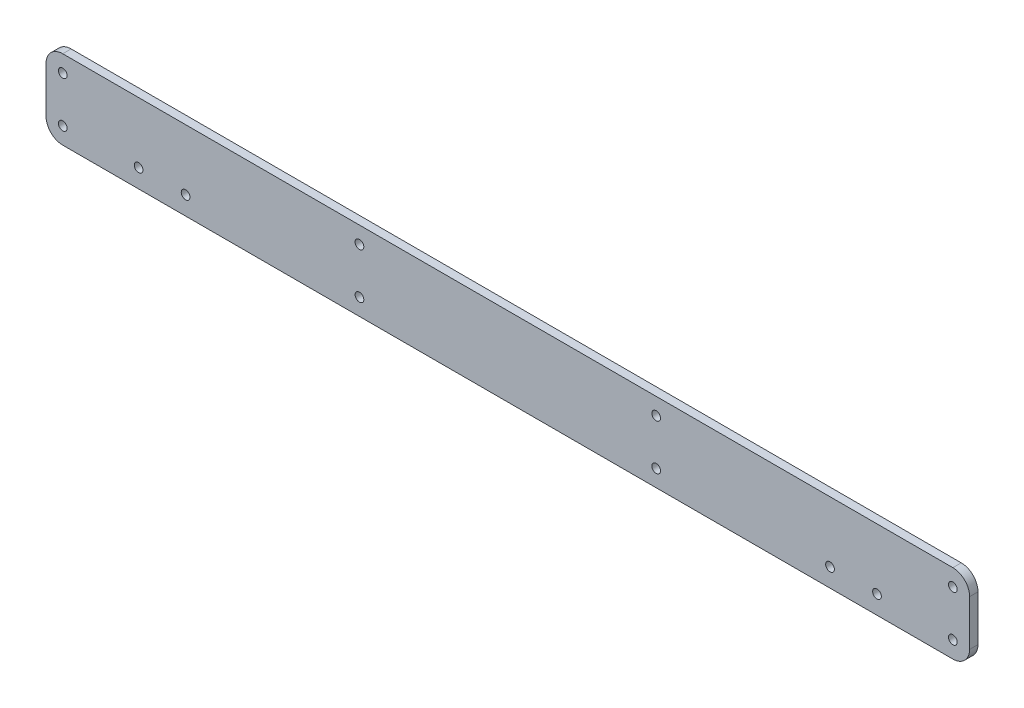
ISO-10303-21;
HEADER;
FILE_DESCRIPTION(('STEP AP214'),'2;1');
FILE_NAME('part.step','',(''),(''),'','','');
FILE_SCHEMA(('AUTOMOTIVE_DESIGN { 1 0 10303 214 1 1 1 1 }'));
ENDSEC;
DATA;
#1=APPLICATION_CONTEXT('core data for automotive mechanical design processes');
#2=APPLICATION_PROTOCOL_DEFINITION('international standard','automotive_design',2000,#1);
#3=PRODUCT_CONTEXT('',#1,'mechanical');
#4=PRODUCT('Part','Part','',(#3));
#5=PRODUCT_RELATED_PRODUCT_CATEGORY('part','',(#4));
#6=PRODUCT_DEFINITION_FORMATION('','',#4);
#7=PRODUCT_DEFINITION_CONTEXT('part definition',#1,'design');
#8=PRODUCT_DEFINITION('design','',#6,#7);
#9=PRODUCT_DEFINITION_SHAPE('','',#8);
#10=(LENGTH_UNIT() NAMED_UNIT(*) SI_UNIT(.MILLI.,.METRE.));
#11=(NAMED_UNIT(*) PLANE_ANGLE_UNIT() SI_UNIT($,.RADIAN.));
#12=(NAMED_UNIT(*) SI_UNIT($,.STERADIAN.) SOLID_ANGLE_UNIT());
#13=UNCERTAINTY_MEASURE_WITH_UNIT(LENGTH_MEASURE(1.E-05),#10,'distance_accuracy_value','');
#14=(GEOMETRIC_REPRESENTATION_CONTEXT(3) GLOBAL_UNCERTAINTY_ASSIGNED_CONTEXT((#13)) GLOBAL_UNIT_ASSIGNED_CONTEXT((#10,
#11,#12)) REPRESENTATION_CONTEXT('',''));
#15=CARTESIAN_POINT('',(0.,0.,0.));
#16=DIRECTION('',(0.,0.,1.));
#17=DIRECTION('',(1.,0.,0.));
#18=AXIS2_PLACEMENT_3D('',#15,#16,#17);
#19=CARTESIAN_POINT('',(0.,0.,-3.175));
#20=DIRECTION('',(0.,0.,1.));
#21=DIRECTION('',(1.,0.,0.));
#22=AXIS2_PLACEMENT_3D('',#19,#20,#21);
#23=PLANE('',#22);
#24=CARTESIAN_POINT('',(168.65,23.65,-3.175));
#25=DIRECTION('',(0.,0.,-1.));
#26=DIRECTION('',(-1.,0.,0.));
#27=AXIS2_PLACEMENT_3D('',#24,#25,#26);
#28=CIRCLE('',#27,1.64999999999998);
#29=CARTESIAN_POINT('',(167.,23.65,-3.175));
#30=VERTEX_POINT('',#29);
#31=EDGE_CURVE('E259',#30,#30,#28,.T.);
#32=ORIENTED_EDGE('',*,*,#31,.F.);
#33=EDGE_LOOP('',(#32));
#34=FACE_BOUND('',#33,.T.);
#35=CARTESIAN_POINT('',(-56.2166666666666,23.65,-3.175));
#36=DIRECTION('',(0.,0.,-1.));
#37=DIRECTION('',(-1.,0.,0.));
#38=AXIS2_PLACEMENT_3D('',#35,#36,#37);
#39=CIRCLE('',#38,1.64999999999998);
#40=CARTESIAN_POINT('',(-57.8666666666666,23.65,-3.175));
#41=VERTEX_POINT('',#40);
#42=EDGE_CURVE('E247',#41,#41,#39,.T.);
#43=ORIENTED_EDGE('',*,*,#42,.F.);
#44=EDGE_LOOP('',(#43));
#45=FACE_BOUND('',#44,.T.);
#46=CARTESIAN_POINT('',(-122.1,6.99999999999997,-3.175));
#47=DIRECTION('',(0.,0.,-1.));
#48=DIRECTION('',(-1.,0.,0.));
#49=AXIS2_PLACEMENT_3D('',#46,#47,#48);
#50=CIRCLE('',#49,1.65);
#51=CARTESIAN_POINT('',(-123.75,6.99999999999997,-3.175));
#52=VERTEX_POINT('',#51);
#53=EDGE_CURVE('E199',#52,#52,#50,.T.);
#54=ORIENTED_EDGE('',*,*,#53,.F.);
#55=EDGE_LOOP('',(#54));
#56=FACE_BOUND('',#55,.T.);
#57=CARTESIAN_POINT('',(-139.9,6.99999999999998,-3.175));
#58=DIRECTION('',(0.,0.,-1.));
#59=DIRECTION('',(-1.,0.,0.));
#60=AXIS2_PLACEMENT_3D('',#57,#58,#59);
#61=CIRCLE('',#60,1.65000000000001);
#62=CARTESIAN_POINT('',(-141.55,6.99999999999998,-3.175));
#63=VERTEX_POINT('',#62);
#64=EDGE_CURVE('E193',#63,#63,#61,.T.);
#65=ORIENTED_EDGE('',*,*,#64,.F.);
#66=EDGE_LOOP('',(#65));
#67=FACE_BOUND('',#66,.T.);
#68=DIRECTION('',(1.,0.,0.));
#69=VECTOR('',#68,1.);
#70=CARTESIAN_POINT('',(-175.,0.,-3.175));
#71=LINE('',#70,#69);
#72=CARTESIAN_POINT('',(-168.65,0.,-3.175));
#73=VERTEX_POINT('',#72);
#74=CARTESIAN_POINT('',(168.65,0.,-3.175));
#75=VERTEX_POINT('',#74);
#76=EDGE_CURVE('E187',#73,#75,#71,.T.);
#77=ORIENTED_EDGE('',*,*,#76,.F.);
#78=CARTESIAN_POINT('',(-168.65,6.34999999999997,-3.175));
#79=DIRECTION('',(0.,0.,1.));
#80=DIRECTION('',(1.,0.,0.));
#81=AXIS2_PLACEMENT_3D('',#78,#79,#80);
#82=CIRCLE('',#81,6.35);
#83=CARTESIAN_POINT('',(-175.,6.34999999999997,-3.175));
#84=VERTEX_POINT('',#83);
#85=EDGE_CURVE('E166',#73,#84,#82,.F.);
#86=ORIENTED_EDGE('',*,*,#85,.T.);
#87=DIRECTION('',(0.,-1.,0.));
#88=VECTOR('',#87,1.);
#89=CARTESIAN_POINT('',(-175.,30.,-3.175));
#90=LINE('',#89,#88);
#91=CARTESIAN_POINT('',(-175.,23.65,-3.175));
#92=VERTEX_POINT('',#91);
#93=EDGE_CURVE('E183',#92,#84,#90,.T.);
#94=ORIENTED_EDGE('',*,*,#93,.F.);
#95=CARTESIAN_POINT('',(-168.65,23.65,-3.175));
#96=DIRECTION('',(0.,0.,1.));
#97=DIRECTION('',(1.,0.,0.));
#98=AXIS2_PLACEMENT_3D('',#95,#96,#97);
#99=CIRCLE('',#98,6.35);
#100=CARTESIAN_POINT('',(-168.65,30.,-3.175));
#101=VERTEX_POINT('',#100);
#102=EDGE_CURVE('E143',#92,#101,#99,.F.);
#103=ORIENTED_EDGE('',*,*,#102,.T.);
#104=DIRECTION('',(-1.,0.,0.));
#105=VECTOR('',#104,1.);
#106=CARTESIAN_POINT('',(-175.,30.,-3.175));
#107=LINE('',#106,#105);
#108=CARTESIAN_POINT('',(168.65,30.,-3.175));
#109=VERTEX_POINT('',#108);
#110=EDGE_CURVE('E144',#109,#101,#107,.T.);
#111=ORIENTED_EDGE('',*,*,#110,.F.);
#112=CARTESIAN_POINT('',(168.65,23.65,-3.175));
#113=DIRECTION('',(0.,0.,1.));
#114=DIRECTION('',(1.,0.,0.));
#115=AXIS2_PLACEMENT_3D('',#112,#113,#114);
#116=CIRCLE('',#115,6.35);
#117=CARTESIAN_POINT('',(175.,23.65,-3.175));
#118=VERTEX_POINT('',#117);
#119=EDGE_CURVE('E66',#109,#118,#116,.F.);
#120=ORIENTED_EDGE('',*,*,#119,.T.);
#121=DIRECTION('',(0.,1.,0.));
#122=VECTOR('',#121,1.);
#123=CARTESIAN_POINT('',(175.,30.,-3.175));
#124=LINE('',#123,#122);
#125=CARTESIAN_POINT('',(175.,6.34999999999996,-3.175));
#126=VERTEX_POINT('',#125);
#127=EDGE_CURVE('E149',#126,#118,#124,.T.);
#128=ORIENTED_EDGE('',*,*,#127,.F.);
#129=CARTESIAN_POINT('',(168.65,6.34999999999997,-3.175));
#130=DIRECTION('',(0.,0.,1.));
#131=DIRECTION('',(1.,0.,0.));
#132=AXIS2_PLACEMENT_3D('',#129,#130,#131);
#133=CIRCLE('',#132,6.35);
#134=EDGE_CURVE('E162',#126,#75,#133,.F.);
#135=ORIENTED_EDGE('',*,*,#134,.T.);
#136=EDGE_LOOP('',(#77,#86,#94,#103,#111,#120,#128,#135));
#137=FACE_BOUND('',#136,.T.);
#138=CARTESIAN_POINT('',(139.9,6.99999999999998,-3.175));
#139=DIRECTION('',(0.,0.,-1.));
#140=DIRECTION('',(-1.,0.,0.));
#141=AXIS2_PLACEMENT_3D('',#138,#139,#140);
#142=CIRCLE('',#141,1.65000000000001);
#143=CARTESIAN_POINT('',(138.25,6.99999999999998,-3.175));
#144=VERTEX_POINT('',#143);
#145=EDGE_CURVE('E205',#144,#144,#142,.T.);
#146=ORIENTED_EDGE('',*,*,#145,.F.);
#147=EDGE_LOOP('',(#146));
#148=FACE_BOUND('',#147,.T.);
#149=CARTESIAN_POINT('',(122.1,6.99999999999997,-3.175));
#150=DIRECTION('',(0.,0.,-1.));
#151=DIRECTION('',(-1.,0.,0.));
#152=AXIS2_PLACEMENT_3D('',#149,#150,#151);
#153=CIRCLE('',#152,1.65);
#154=CARTESIAN_POINT('',(120.45,6.99999999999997,-3.175));
#155=VERTEX_POINT('',#154);
#156=EDGE_CURVE('E211',#155,#155,#153,.T.);
#157=ORIENTED_EDGE('',*,*,#156,.F.);
#158=EDGE_LOOP('',(#157));
#159=FACE_BOUND('',#158,.T.);
#160=CARTESIAN_POINT('',(-168.65,6.34999999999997,-3.175));
#161=DIRECTION('',(0.,0.,-1.));
#162=DIRECTION('',(-1.,0.,0.));
#163=AXIS2_PLACEMENT_3D('',#160,#161,#162);
#164=CIRCLE('',#163,1.64999999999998);
#165=CARTESIAN_POINT('',(-170.3,6.34999999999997,-3.175));
#166=VERTEX_POINT('',#165);
#167=EDGE_CURVE('E217',#166,#166,#164,.T.);
#168=ORIENTED_EDGE('',*,*,#167,.F.);
#169=EDGE_LOOP('',(#168));
#170=FACE_BOUND('',#169,.T.);
#171=CARTESIAN_POINT('',(-56.2166666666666,6.34999999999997,-3.175));
#172=DIRECTION('',(0.,0.,-1.));
#173=DIRECTION('',(-1.,0.,0.));
#174=AXIS2_PLACEMENT_3D('',#171,#172,#173);
#175=CIRCLE('',#174,1.64999999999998);
#176=CARTESIAN_POINT('',(-57.8666666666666,6.34999999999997,-3.175));
#177=VERTEX_POINT('',#176);
#178=EDGE_CURVE('E223',#177,#177,#175,.T.);
#179=ORIENTED_EDGE('',*,*,#178,.F.);
#180=EDGE_LOOP('',(#179));
#181=FACE_BOUND('',#180,.T.);
#182=CARTESIAN_POINT('',(56.2166666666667,6.34999999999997,-3.175));
#183=DIRECTION('',(0.,0.,-1.));
#184=DIRECTION('',(-1.,0.,0.));
#185=AXIS2_PLACEMENT_3D('',#182,#183,#184);
#186=CIRCLE('',#185,1.64999999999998);
#187=CARTESIAN_POINT('',(54.5666666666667,6.34999999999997,-3.175));
#188=VERTEX_POINT('',#187);
#189=EDGE_CURVE('E229',#188,#188,#186,.T.);
#190=ORIENTED_EDGE('',*,*,#189,.F.);
#191=EDGE_LOOP('',(#190));
#192=FACE_BOUND('',#191,.T.);
#193=CARTESIAN_POINT('',(168.65,6.34999999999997,-3.175));
#194=DIRECTION('',(0.,0.,-1.));
#195=DIRECTION('',(-1.,0.,0.));
#196=AXIS2_PLACEMENT_3D('',#193,#194,#195);
#197=CIRCLE('',#196,1.64999999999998);
#198=CARTESIAN_POINT('',(167.,6.34999999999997,-3.175));
#199=VERTEX_POINT('',#198);
#200=EDGE_CURVE('E235',#199,#199,#197,.T.);
#201=ORIENTED_EDGE('',*,*,#200,.F.);
#202=EDGE_LOOP('',(#201));
#203=FACE_BOUND('',#202,.T.);
#204=CARTESIAN_POINT('',(-168.65,23.65,-3.175));
#205=DIRECTION('',(0.,0.,-1.));
#206=DIRECTION('',(-1.,0.,0.));
#207=AXIS2_PLACEMENT_3D('',#204,#205,#206);
#208=CIRCLE('',#207,1.64999999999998);
#209=CARTESIAN_POINT('',(-170.3,23.65,-3.175));
#210=VERTEX_POINT('',#209);
#211=EDGE_CURVE('E241',#210,#210,#208,.T.);
#212=ORIENTED_EDGE('',*,*,#211,.F.);
#213=EDGE_LOOP('',(#212));
#214=FACE_BOUND('',#213,.T.);
#215=CARTESIAN_POINT('',(56.2166666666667,23.65,-3.175));
#216=DIRECTION('',(0.,0.,-1.));
#217=DIRECTION('',(-1.,0.,0.));
#218=AXIS2_PLACEMENT_3D('',#215,#216,#217);
#219=CIRCLE('',#218,1.64999999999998);
#220=CARTESIAN_POINT('',(54.5666666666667,23.65,-3.175));
#221=VERTEX_POINT('',#220);
#222=EDGE_CURVE('E253',#221,#221,#219,.T.);
#223=ORIENTED_EDGE('',*,*,#222,.F.);
#224=EDGE_LOOP('',(#223));
#225=FACE_BOUND('',#224,.T.);
#226=ADVANCED_FACE('F51',(#34,#45,#56,#67,#137,#148,#159,#170,#181,#192,#203,#214,#225),#23,.F.);
#227=CARTESIAN_POINT('',(-175.,30.,-3.175));
#228=DIRECTION('',(-1.,0.,0.));
#229=DIRECTION('',(0.,0.,1.));
#230=AXIS2_PLACEMENT_3D('',#227,#228,#229);
#231=PLANE('',#230);
#232=ORIENTED_EDGE('',*,*,#93,.T.);
#233=DIRECTION('',(0.,0.,1.));
#234=VECTOR('',#233,1.);
#235=CARTESIAN_POINT('',(-175.,6.34999999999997,-3.175));
#236=LINE('',#235,#234);
#237=CARTESIAN_POINT('',(-175.,6.34999999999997,0.));
#238=VERTEX_POINT('',#237);
#239=EDGE_CURVE('E137',#84,#238,#236,.T.);
#240=ORIENTED_EDGE('',*,*,#239,.T.);
#241=DIRECTION('',(0.,-1.,0.));
#242=VECTOR('',#241,1.);
#243=CARTESIAN_POINT('',(-175.,30.,0.));
#244=LINE('',#243,#242);
#245=CARTESIAN_POINT('',(-175.,23.65,0.));
#246=VERTEX_POINT('',#245);
#247=EDGE_CURVE('E120',#246,#238,#244,.T.);
#248=ORIENTED_EDGE('',*,*,#247,.F.);
#249=DIRECTION('',(0.,0.,1.));
#250=VECTOR('',#249,1.);
#251=CARTESIAN_POINT('',(-175.,23.65,-3.175));
#252=LINE('',#251,#250);
#253=EDGE_CURVE('E134',#246,#92,#252,.F.);
#254=ORIENTED_EDGE('',*,*,#253,.T.);
#255=EDGE_LOOP('',(#232,#240,#248,#254));
#256=FACE_BOUND('',#255,.T.);
#257=ADVANCED_FACE('F133',(#256),#231,.T.);
#258=CARTESIAN_POINT('',(-175.,30.,-3.175));
#259=DIRECTION('',(0.,1.,0.));
#260=DIRECTION('',(0.,0.,1.));
#261=AXIS2_PLACEMENT_3D('',#258,#259,#260);
#262=PLANE('',#261);
#263=ORIENTED_EDGE('',*,*,#110,.T.);
#264=DIRECTION('',(0.,0.,1.));
#265=VECTOR('',#264,1.);
#266=CARTESIAN_POINT('',(-168.65,30.,-3.175));
#267=LINE('',#266,#265);
#268=CARTESIAN_POINT('',(-168.65,30.,0.));
#269=VERTEX_POINT('',#268);
#270=EDGE_CURVE('E170',#101,#269,#267,.T.);
#271=ORIENTED_EDGE('',*,*,#270,.T.);
#272=DIRECTION('',(-1.,0.,0.));
#273=VECTOR('',#272,1.);
#274=CARTESIAN_POINT('',(-175.,30.,0.));
#275=LINE('',#274,#273);
#276=CARTESIAN_POINT('',(168.65,30.,0.));
#277=VERTEX_POINT('',#276);
#278=EDGE_CURVE('E122',#277,#269,#275,.T.);
#279=ORIENTED_EDGE('',*,*,#278,.F.);
#280=DIRECTION('',(0.,0.,1.));
#281=VECTOR('',#280,1.);
#282=CARTESIAN_POINT('',(168.65,30.,-3.175));
#283=LINE('',#282,#281);
#284=EDGE_CURVE('E168',#277,#109,#283,.F.);
#285=ORIENTED_EDGE('',*,*,#284,.T.);
#286=EDGE_LOOP('',(#263,#271,#279,#285));
#287=FACE_BOUND('',#286,.T.);
#288=ADVANCED_FACE('F172',(#287),#262,.T.);
#289=CARTESIAN_POINT('',(175.,30.,-3.175));
#290=DIRECTION('',(1.,0.,0.));
#291=DIRECTION('',(0.,1.,0.));
#292=AXIS2_PLACEMENT_3D('',#289,#290,#291);
#293=PLANE('',#292);
#294=ORIENTED_EDGE('',*,*,#127,.T.);
#295=DIRECTION('',(0.,0.,1.));
#296=VECTOR('',#295,1.);
#297=CARTESIAN_POINT('',(175.,23.65,-3.175));
#298=LINE('',#297,#296);
#299=CARTESIAN_POINT('',(175.,23.65,0.));
#300=VERTEX_POINT('',#299);
#301=EDGE_CURVE('E11',#118,#300,#298,.T.);
#302=ORIENTED_EDGE('',*,*,#301,.T.);
#303=DIRECTION('',(0.,1.,0.));
#304=VECTOR('',#303,1.);
#305=CARTESIAN_POINT('',(175.,30.,0.));
#306=LINE('',#305,#304);
#307=CARTESIAN_POINT('',(175.,6.34999999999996,0.));
#308=VERTEX_POINT('',#307);
#309=EDGE_CURVE('E181',#308,#300,#306,.T.);
#310=ORIENTED_EDGE('',*,*,#309,.F.);
#311=DIRECTION('',(0.,0.,1.));
#312=VECTOR('',#311,1.);
#313=CARTESIAN_POINT('',(175.,6.34999999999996,-3.175));
#314=LINE('',#313,#312);
#315=EDGE_CURVE('E59',#308,#126,#314,.F.);
#316=ORIENTED_EDGE('',*,*,#315,.T.);
#317=EDGE_LOOP('',(#294,#302,#310,#316));
#318=FACE_BOUND('',#317,.T.);
#319=ADVANCED_FACE('F180',(#318),#293,.T.);
#320=CARTESIAN_POINT('',(-175.,0.,-3.175));
#321=DIRECTION('',(0.,-1.,0.));
#322=DIRECTION('',(1.,0.,0.));
#323=AXIS2_PLACEMENT_3D('',#320,#321,#322);
#324=PLANE('',#323);
#325=DIRECTION('',(1.,0.,0.));
#326=VECTOR('',#325,1.);
#327=CARTESIAN_POINT('',(-175.,0.,0.));
#328=LINE('',#327,#326);
#329=CARTESIAN_POINT('',(-168.65,0.,0.));
#330=VERTEX_POINT('',#329);
#331=CARTESIAN_POINT('',(168.65,0.,0.));
#332=VERTEX_POINT('',#331);
#333=EDGE_CURVE('E138',#330,#332,#328,.T.);
#334=ORIENTED_EDGE('',*,*,#333,.F.);
#335=DIRECTION('',(0.,0.,1.));
#336=VECTOR('',#335,1.);
#337=CARTESIAN_POINT('',(-168.65,0.,-3.175));
#338=LINE('',#337,#336);
#339=EDGE_CURVE('E160',#330,#73,#338,.F.);
#340=ORIENTED_EDGE('',*,*,#339,.T.);
#341=ORIENTED_EDGE('',*,*,#76,.T.);
#342=DIRECTION('',(0.,0.,1.));
#343=VECTOR('',#342,1.);
#344=CARTESIAN_POINT('',(168.65,0.,-3.175));
#345=LINE('',#344,#343);
#346=EDGE_CURVE('E157',#75,#332,#345,.T.);
#347=ORIENTED_EDGE('',*,*,#346,.T.);
#348=EDGE_LOOP('',(#334,#340,#341,#347));
#349=FACE_BOUND('',#348,.T.);
#350=ADVANCED_FACE('F284',(#349),#324,.T.);
#351=CARTESIAN_POINT('',(0.,0.,0.));
#352=DIRECTION('',(0.,0.,1.));
#353=DIRECTION('',(1.,0.,0.));
#354=AXIS2_PLACEMENT_3D('',#351,#352,#353);
#355=PLANE('',#354);
#356=CARTESIAN_POINT('',(168.65,23.65,0.));
#357=DIRECTION('',(0.,0.,1.));
#358=DIRECTION('',(1.,0.,0.));
#359=AXIS2_PLACEMENT_3D('',#356,#357,#358);
#360=CIRCLE('',#359,1.65);
#361=CARTESIAN_POINT('',(170.3,23.65,0.));
#362=VERTEX_POINT('',#361);
#363=EDGE_CURVE('E256',#362,#362,#360,.T.);
#364=ORIENTED_EDGE('',*,*,#363,.F.);
#365=EDGE_LOOP('',(#364));
#366=FACE_BOUND('',#365,.T.);
#367=CARTESIAN_POINT('',(56.2166666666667,23.65,0.));
#368=DIRECTION('',(0.,0.,1.));
#369=DIRECTION('',(1.,0.,0.));
#370=AXIS2_PLACEMENT_3D('',#367,#368,#369);
#371=CIRCLE('',#370,1.64999999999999);
#372=CARTESIAN_POINT('',(57.8666666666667,23.65,0.));
#373=VERTEX_POINT('',#372);
#374=EDGE_CURVE('E250',#373,#373,#371,.T.);
#375=ORIENTED_EDGE('',*,*,#374,.F.);
#376=EDGE_LOOP('',(#375));
#377=FACE_BOUND('',#376,.T.);
#378=CARTESIAN_POINT('',(-56.2166666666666,23.65,0.));
#379=DIRECTION('',(0.,0.,1.));
#380=DIRECTION('',(1.,0.,0.));
#381=AXIS2_PLACEMENT_3D('',#378,#379,#380);
#382=CIRCLE('',#381,1.64999999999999);
#383=CARTESIAN_POINT('',(-54.5666666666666,23.65,0.));
#384=VERTEX_POINT('',#383);
#385=EDGE_CURVE('E244',#384,#384,#382,.T.);
#386=ORIENTED_EDGE('',*,*,#385,.F.);
#387=EDGE_LOOP('',(#386));
#388=FACE_BOUND('',#387,.T.);
#389=CARTESIAN_POINT('',(-168.65,23.65,0.));
#390=DIRECTION('',(0.,0.,1.));
#391=DIRECTION('',(1.,0.,0.));
#392=AXIS2_PLACEMENT_3D('',#389,#390,#391);
#393=CIRCLE('',#392,1.65);
#394=CARTESIAN_POINT('',(-167.,23.65,0.));
#395=VERTEX_POINT('',#394);
#396=EDGE_CURVE('E238',#395,#395,#393,.T.);
#397=ORIENTED_EDGE('',*,*,#396,.F.);
#398=EDGE_LOOP('',(#397));
#399=FACE_BOUND('',#398,.T.);
#400=CARTESIAN_POINT('',(168.65,6.34999999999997,0.));
#401=DIRECTION('',(0.,0.,1.));
#402=DIRECTION('',(1.,0.,0.));
#403=AXIS2_PLACEMENT_3D('',#400,#401,#402);
#404=CIRCLE('',#403,1.65);
#405=CARTESIAN_POINT('',(170.3,6.34999999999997,0.));
#406=VERTEX_POINT('',#405);
#407=EDGE_CURVE('E232',#406,#406,#404,.T.);
#408=ORIENTED_EDGE('',*,*,#407,.F.);
#409=EDGE_LOOP('',(#408));
#410=FACE_BOUND('',#409,.T.);
#411=CARTESIAN_POINT('',(56.2166666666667,6.34999999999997,0.));
#412=DIRECTION('',(0.,0.,1.));
#413=DIRECTION('',(1.,0.,0.));
#414=AXIS2_PLACEMENT_3D('',#411,#412,#413);
#415=CIRCLE('',#414,1.64999999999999);
#416=CARTESIAN_POINT('',(57.8666666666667,6.34999999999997,0.));
#417=VERTEX_POINT('',#416);
#418=EDGE_CURVE('E226',#417,#417,#415,.T.);
#419=ORIENTED_EDGE('',*,*,#418,.F.);
#420=EDGE_LOOP('',(#419));
#421=FACE_BOUND('',#420,.T.);
#422=CARTESIAN_POINT('',(-56.2166666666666,6.34999999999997,0.));
#423=DIRECTION('',(0.,0.,1.));
#424=DIRECTION('',(1.,0.,0.));
#425=AXIS2_PLACEMENT_3D('',#422,#423,#424);
#426=CIRCLE('',#425,1.64999999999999);
#427=CARTESIAN_POINT('',(-54.5666666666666,6.34999999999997,0.));
#428=VERTEX_POINT('',#427);
#429=EDGE_CURVE('E220',#428,#428,#426,.T.);
#430=ORIENTED_EDGE('',*,*,#429,.F.);
#431=EDGE_LOOP('',(#430));
#432=FACE_BOUND('',#431,.T.);
#433=CARTESIAN_POINT('',(-168.65,6.34999999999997,0.));
#434=DIRECTION('',(0.,0.,1.));
#435=DIRECTION('',(1.,0.,0.));
#436=AXIS2_PLACEMENT_3D('',#433,#434,#435);
#437=CIRCLE('',#436,1.65);
#438=CARTESIAN_POINT('',(-167.,6.34999999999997,0.));
#439=VERTEX_POINT('',#438);
#440=EDGE_CURVE('E214',#439,#439,#437,.T.);
#441=ORIENTED_EDGE('',*,*,#440,.F.);
#442=EDGE_LOOP('',(#441));
#443=FACE_BOUND('',#442,.T.);
#444=CARTESIAN_POINT('',(122.1,6.99999999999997,0.));
#445=DIRECTION('',(0.,0.,1.));
#446=DIRECTION('',(1.,0.,0.));
#447=AXIS2_PLACEMENT_3D('',#444,#445,#446);
#448=CIRCLE('',#447,1.65);
#449=CARTESIAN_POINT('',(123.75,6.99999999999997,0.));
#450=VERTEX_POINT('',#449);
#451=EDGE_CURVE('E208',#450,#450,#448,.T.);
#452=ORIENTED_EDGE('',*,*,#451,.F.);
#453=EDGE_LOOP('',(#452));
#454=FACE_BOUND('',#453,.T.);
#455=CARTESIAN_POINT('',(139.9,6.99999999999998,0.));
#456=DIRECTION('',(0.,0.,1.));
#457=DIRECTION('',(1.,0.,0.));
#458=AXIS2_PLACEMENT_3D('',#455,#456,#457);
#459=CIRCLE('',#458,1.65000000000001);
#460=CARTESIAN_POINT('',(141.55,6.99999999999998,0.));
#461=VERTEX_POINT('',#460);
#462=EDGE_CURVE('E202',#461,#461,#459,.T.);
#463=ORIENTED_EDGE('',*,*,#462,.F.);
#464=EDGE_LOOP('',(#463));
#465=FACE_BOUND('',#464,.T.);
#466=CARTESIAN_POINT('',(-122.1,6.99999999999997,0.));
#467=DIRECTION('',(0.,0.,1.));
#468=DIRECTION('',(1.,0.,0.));
#469=AXIS2_PLACEMENT_3D('',#466,#467,#468);
#470=CIRCLE('',#469,1.65);
#471=CARTESIAN_POINT('',(-120.45,6.99999999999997,0.));
#472=VERTEX_POINT('',#471);
#473=EDGE_CURVE('E196',#472,#472,#470,.T.);
#474=ORIENTED_EDGE('',*,*,#473,.F.);
#475=EDGE_LOOP('',(#474));
#476=FACE_BOUND('',#475,.T.);
#477=CARTESIAN_POINT('',(-139.9,6.99999999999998,0.));
#478=DIRECTION('',(0.,0.,1.));
#479=DIRECTION('',(1.,0.,0.));
#480=AXIS2_PLACEMENT_3D('',#477,#478,#479);
#481=CIRCLE('',#480,1.65000000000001);
#482=CARTESIAN_POINT('',(-138.25,6.99999999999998,0.));
#483=VERTEX_POINT('',#482);
#484=EDGE_CURVE('E139',#483,#483,#481,.T.);
#485=ORIENTED_EDGE('',*,*,#484,.F.);
#486=EDGE_LOOP('',(#485));
#487=FACE_BOUND('',#486,.T.);
#488=ORIENTED_EDGE('',*,*,#247,.T.);
#489=CARTESIAN_POINT('',(-168.65,6.34999999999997,0.));
#490=DIRECTION('',(0.,0.,1.));
#491=DIRECTION('',(1.,0.,0.));
#492=AXIS2_PLACEMENT_3D('',#489,#490,#491);
#493=CIRCLE('',#492,6.35);
#494=EDGE_CURVE('E127',#238,#330,#493,.T.);
#495=ORIENTED_EDGE('',*,*,#494,.T.);
#496=ORIENTED_EDGE('',*,*,#333,.T.);
#497=CARTESIAN_POINT('',(168.65,6.34999999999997,0.));
#498=DIRECTION('',(0.,0.,1.));
#499=DIRECTION('',(1.,0.,0.));
#500=AXIS2_PLACEMENT_3D('',#497,#498,#499);
#501=CIRCLE('',#500,6.35);
#502=EDGE_CURVE('E146',#332,#308,#501,.T.);
#503=ORIENTED_EDGE('',*,*,#502,.T.);
#504=ORIENTED_EDGE('',*,*,#309,.T.);
#505=CARTESIAN_POINT('',(168.65,23.65,0.));
#506=DIRECTION('',(0.,0.,1.));
#507=DIRECTION('',(1.,0.,0.));
#508=AXIS2_PLACEMENT_3D('',#505,#506,#507);
#509=CIRCLE('',#508,6.35);
#510=EDGE_CURVE('E128',#300,#277,#509,.T.);
#511=ORIENTED_EDGE('',*,*,#510,.T.);
#512=ORIENTED_EDGE('',*,*,#278,.T.);
#513=CARTESIAN_POINT('',(-168.65,23.65,0.));
#514=DIRECTION('',(0.,0.,1.));
#515=DIRECTION('',(1.,0.,0.));
#516=AXIS2_PLACEMENT_3D('',#513,#514,#515);
#517=CIRCLE('',#516,6.35);
#518=EDGE_CURVE('E117',#269,#246,#517,.T.);
#519=ORIENTED_EDGE('',*,*,#518,.T.);
#520=EDGE_LOOP('',(#488,#495,#496,#503,#504,#511,#512,#519));
#521=FACE_BOUND('',#520,.T.);
#522=ADVANCED_FACE('F119',(#366,#377,#388,#399,#410,#421,#432,#443,#454,#465,#476,#487,#521),
#355,.T.);
#523=CARTESIAN_POINT('',(-168.65,6.34999999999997,-3.175));
#524=DIRECTION('',(0.,0.,1.));
#525=DIRECTION('',(1.,0.,0.));
#526=AXIS2_PLACEMENT_3D('',#523,#524,#525);
#527=CYLINDRICAL_SURFACE('',#526,6.35);
#528=ORIENTED_EDGE('',*,*,#85,.F.);
#529=ORIENTED_EDGE('',*,*,#339,.F.);
#530=ORIENTED_EDGE('',*,*,#494,.F.);
#531=ORIENTED_EDGE('',*,*,#239,.F.);
#532=EDGE_LOOP('',(#528,#529,#530,#531));
#533=FACE_BOUND('',#532,.T.);
#534=ADVANCED_FACE('F283',(#533),#527,.T.);
#535=CARTESIAN_POINT('',(-168.65,23.65,-3.175));
#536=DIRECTION('',(0.,0.,1.));
#537=DIRECTION('',(1.,0.,0.));
#538=AXIS2_PLACEMENT_3D('',#535,#536,#537);
#539=CYLINDRICAL_SURFACE('',#538,6.35);
#540=ORIENTED_EDGE('',*,*,#102,.F.);
#541=ORIENTED_EDGE('',*,*,#253,.F.);
#542=ORIENTED_EDGE('',*,*,#518,.F.);
#543=ORIENTED_EDGE('',*,*,#270,.F.);
#544=EDGE_LOOP('',(#540,#541,#542,#543));
#545=FACE_BOUND('',#544,.T.);
#546=ADVANCED_FACE('F142',(#545),#539,.T.);
#547=CARTESIAN_POINT('',(168.65,23.65,-3.175));
#548=DIRECTION('',(0.,0.,1.));
#549=DIRECTION('',(1.,0.,0.));
#550=AXIS2_PLACEMENT_3D('',#547,#548,#549);
#551=CYLINDRICAL_SURFACE('',#550,6.35);
#552=ORIENTED_EDGE('',*,*,#119,.F.);
#553=ORIENTED_EDGE('',*,*,#284,.F.);
#554=ORIENTED_EDGE('',*,*,#510,.F.);
#555=ORIENTED_EDGE('',*,*,#301,.F.);
#556=EDGE_LOOP('',(#552,#553,#554,#555));
#557=FACE_BOUND('',#556,.T.);
#558=ADVANCED_FACE('F178',(#557),#551,.T.);
#559=CARTESIAN_POINT('',(168.65,6.34999999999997,-3.175));
#560=DIRECTION('',(0.,0.,1.));
#561=DIRECTION('',(1.,0.,0.));
#562=AXIS2_PLACEMENT_3D('',#559,#560,#561);
#563=CYLINDRICAL_SURFACE('',#562,6.35);
#564=ORIENTED_EDGE('',*,*,#134,.F.);
#565=ORIENTED_EDGE('',*,*,#315,.F.);
#566=ORIENTED_EDGE('',*,*,#502,.F.);
#567=ORIENTED_EDGE('',*,*,#346,.F.);
#568=EDGE_LOOP('',(#564,#565,#566,#567));
#569=FACE_BOUND('',#568,.T.);
#570=ADVANCED_FACE('F53',(#569),#563,.T.);
#571=CARTESIAN_POINT('',(-139.9,6.99999999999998,-3.175));
#572=DIRECTION('',(0.,0.,-1.));
#573=DIRECTION('',(-1.,0.,0.));
#574=AXIS2_PLACEMENT_3D('',#571,#572,#573);
#575=CYLINDRICAL_SURFACE('',#574,1.65000000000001);
#576=ORIENTED_EDGE('',*,*,#64,.T.);
#577=EDGE_LOOP('',(#576));
#578=FACE_BOUND('',#577,.T.);
#579=ORIENTED_EDGE('',*,*,#484,.T.);
#580=EDGE_LOOP('',(#579));
#581=FACE_BOUND('',#580,.T.);
#582=ADVANCED_FACE('F275',(#578,#581),#575,.F.);
#583=CARTESIAN_POINT('',(-122.1,6.99999999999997,-3.175));
#584=DIRECTION('',(0.,0.,-1.));
#585=DIRECTION('',(-1.,0.,0.));
#586=AXIS2_PLACEMENT_3D('',#583,#584,#585);
#587=CYLINDRICAL_SURFACE('',#586,1.65);
#588=ORIENTED_EDGE('',*,*,#53,.T.);
#589=EDGE_LOOP('',(#588));
#590=FACE_BOUND('',#589,.T.);
#591=ORIENTED_EDGE('',*,*,#473,.T.);
#592=EDGE_LOOP('',(#591));
#593=FACE_BOUND('',#592,.T.);
#594=ADVANCED_FACE('F278',(#590,#593),#587,.F.);
#595=CARTESIAN_POINT('',(139.9,6.99999999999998,-3.175));
#596=DIRECTION('',(0.,0.,-1.));
#597=DIRECTION('',(-1.,0.,0.));
#598=AXIS2_PLACEMENT_3D('',#595,#596,#597);
#599=CYLINDRICAL_SURFACE('',#598,1.65000000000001);
#600=ORIENTED_EDGE('',*,*,#145,.T.);
#601=EDGE_LOOP('',(#600));
#602=FACE_BOUND('',#601,.T.);
#603=ORIENTED_EDGE('',*,*,#462,.T.);
#604=EDGE_LOOP('',(#603));
#605=FACE_BOUND('',#604,.T.);
#606=ADVANCED_FACE('F336',(#602,#605),#599,.F.);
#607=CARTESIAN_POINT('',(122.1,6.99999999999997,-3.175));
#608=DIRECTION('',(0.,0.,-1.));
#609=DIRECTION('',(-1.,0.,0.));
#610=AXIS2_PLACEMENT_3D('',#607,#608,#609);
#611=CYLINDRICAL_SURFACE('',#610,1.65);
#612=ORIENTED_EDGE('',*,*,#156,.T.);
#613=EDGE_LOOP('',(#612));
#614=FACE_BOUND('',#613,.T.);
#615=ORIENTED_EDGE('',*,*,#451,.T.);
#616=EDGE_LOOP('',(#615));
#617=FACE_BOUND('',#616,.T.);
#618=ADVANCED_FACE('F350',(#614,#617),#611,.F.);
#619=CARTESIAN_POINT('',(-168.65,6.34999999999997,-3.175));
#620=DIRECTION('',(0.,0.,-1.));
#621=DIRECTION('',(-1.,0.,0.));
#622=AXIS2_PLACEMENT_3D('',#619,#620,#621);
#623=CYLINDRICAL_SURFACE('',#622,1.65);
#624=ORIENTED_EDGE('',*,*,#167,.T.);
#625=EDGE_LOOP('',(#624));
#626=FACE_BOUND('',#625,.T.);
#627=ORIENTED_EDGE('',*,*,#440,.T.);
#628=EDGE_LOOP('',(#627));
#629=FACE_BOUND('',#628,.T.);
#630=ADVANCED_FACE('F362',(#626,#629),#623,.F.);
#631=CARTESIAN_POINT('',(-56.2166666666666,6.34999999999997,-3.175));
#632=DIRECTION('',(0.,0.,-1.));
#633=DIRECTION('',(-1.,0.,0.));
#634=AXIS2_PLACEMENT_3D('',#631,#632,#633);
#635=CYLINDRICAL_SURFACE('',#634,1.64999999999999);
#636=ORIENTED_EDGE('',*,*,#178,.T.);
#637=EDGE_LOOP('',(#636));
#638=FACE_BOUND('',#637,.T.);
#639=ORIENTED_EDGE('',*,*,#429,.T.);
#640=EDGE_LOOP('',(#639));
#641=FACE_BOUND('',#640,.T.);
#642=ADVANCED_FACE('F383',(#638,#641),#635,.F.);
#643=CARTESIAN_POINT('',(56.2166666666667,6.34999999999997,-3.175));
#644=DIRECTION('',(0.,0.,-1.));
#645=DIRECTION('',(-1.,0.,0.));
#646=AXIS2_PLACEMENT_3D('',#643,#644,#645);
#647=CYLINDRICAL_SURFACE('',#646,1.64999999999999);
#648=ORIENTED_EDGE('',*,*,#189,.T.);
#649=EDGE_LOOP('',(#648));
#650=FACE_BOUND('',#649,.T.);
#651=ORIENTED_EDGE('',*,*,#418,.T.);
#652=EDGE_LOOP('',(#651));
#653=FACE_BOUND('',#652,.T.);
#654=ADVANCED_FACE('F394',(#650,#653),#647,.F.);
#655=CARTESIAN_POINT('',(168.65,6.34999999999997,-3.175));
#656=DIRECTION('',(0.,0.,-1.));
#657=DIRECTION('',(-1.,0.,0.));
#658=AXIS2_PLACEMENT_3D('',#655,#656,#657);
#659=CYLINDRICAL_SURFACE('',#658,1.65);
#660=ORIENTED_EDGE('',*,*,#200,.T.);
#661=EDGE_LOOP('',(#660));
#662=FACE_BOUND('',#661,.T.);
#663=ORIENTED_EDGE('',*,*,#407,.T.);
#664=EDGE_LOOP('',(#663));
#665=FACE_BOUND('',#664,.T.);
#666=ADVANCED_FACE('F406',(#662,#665),#659,.F.);
#667=CARTESIAN_POINT('',(-168.65,23.65,-3.175));
#668=DIRECTION('',(0.,0.,-1.));
#669=DIRECTION('',(-1.,0.,0.));
#670=AXIS2_PLACEMENT_3D('',#667,#668,#669);
#671=CYLINDRICAL_SURFACE('',#670,1.65);
#672=ORIENTED_EDGE('',*,*,#211,.T.);
#673=EDGE_LOOP('',(#672));
#674=FACE_BOUND('',#673,.T.);
#675=ORIENTED_EDGE('',*,*,#396,.T.);
#676=EDGE_LOOP('',(#675));
#677=FACE_BOUND('',#676,.T.);
#678=ADVANCED_FACE('F418',(#674,#677),#671,.F.);
#679=CARTESIAN_POINT('',(-56.2166666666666,23.65,-3.175));
#680=DIRECTION('',(0.,0.,-1.));
#681=DIRECTION('',(-1.,0.,0.));
#682=AXIS2_PLACEMENT_3D('',#679,#680,#681);
#683=CYLINDRICAL_SURFACE('',#682,1.64999999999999);
#684=ORIENTED_EDGE('',*,*,#42,.T.);
#685=EDGE_LOOP('',(#684));
#686=FACE_BOUND('',#685,.T.);
#687=ORIENTED_EDGE('',*,*,#385,.T.);
#688=EDGE_LOOP('',(#687));
#689=FACE_BOUND('',#688,.T.);
#690=ADVANCED_FACE('F430',(#686,#689),#683,.F.);
#691=CARTESIAN_POINT('',(56.2166666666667,23.65,-3.175));
#692=DIRECTION('',(0.,0.,-1.));
#693=DIRECTION('',(-1.,0.,0.));
#694=AXIS2_PLACEMENT_3D('',#691,#692,#693);
#695=CYLINDRICAL_SURFACE('',#694,1.64999999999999);
#696=ORIENTED_EDGE('',*,*,#222,.T.);
#697=EDGE_LOOP('',(#696));
#698=FACE_BOUND('',#697,.T.);
#699=ORIENTED_EDGE('',*,*,#374,.T.);
#700=EDGE_LOOP('',(#699));
#701=FACE_BOUND('',#700,.T.);
#702=ADVANCED_FACE('F442',(#698,#701),#695,.F.);
#703=CARTESIAN_POINT('',(168.65,23.65,-3.175));
#704=DIRECTION('',(0.,0.,-1.));
#705=DIRECTION('',(-1.,0.,0.));
#706=AXIS2_PLACEMENT_3D('',#703,#704,#705);
#707=CYLINDRICAL_SURFACE('',#706,1.65);
#708=ORIENTED_EDGE('',*,*,#31,.T.);
#709=EDGE_LOOP('',(#708));
#710=FACE_BOUND('',#709,.T.);
#711=ORIENTED_EDGE('',*,*,#363,.T.);
#712=EDGE_LOOP('',(#711));
#713=FACE_BOUND('',#712,.T.);
#714=ADVANCED_FACE('F263',(#710,#713),#707,.F.);
#715=CLOSED_SHELL('',(#226,#257,#288,#319,#350,#522,#534,#546,#558,#570,#582,#594,#606,#618,
#630,#642,#654,#666,#678,#690,#702,#714));
#716=MANIFOLD_SOLID_BREP('B2',#715);
#717=ADVANCED_BREP_SHAPE_REPRESENTATION('',(#18,#716),#14);
#718=SHAPE_DEFINITION_REPRESENTATION(#9,#717);
ENDSEC;
END-ISO-10303-21;
